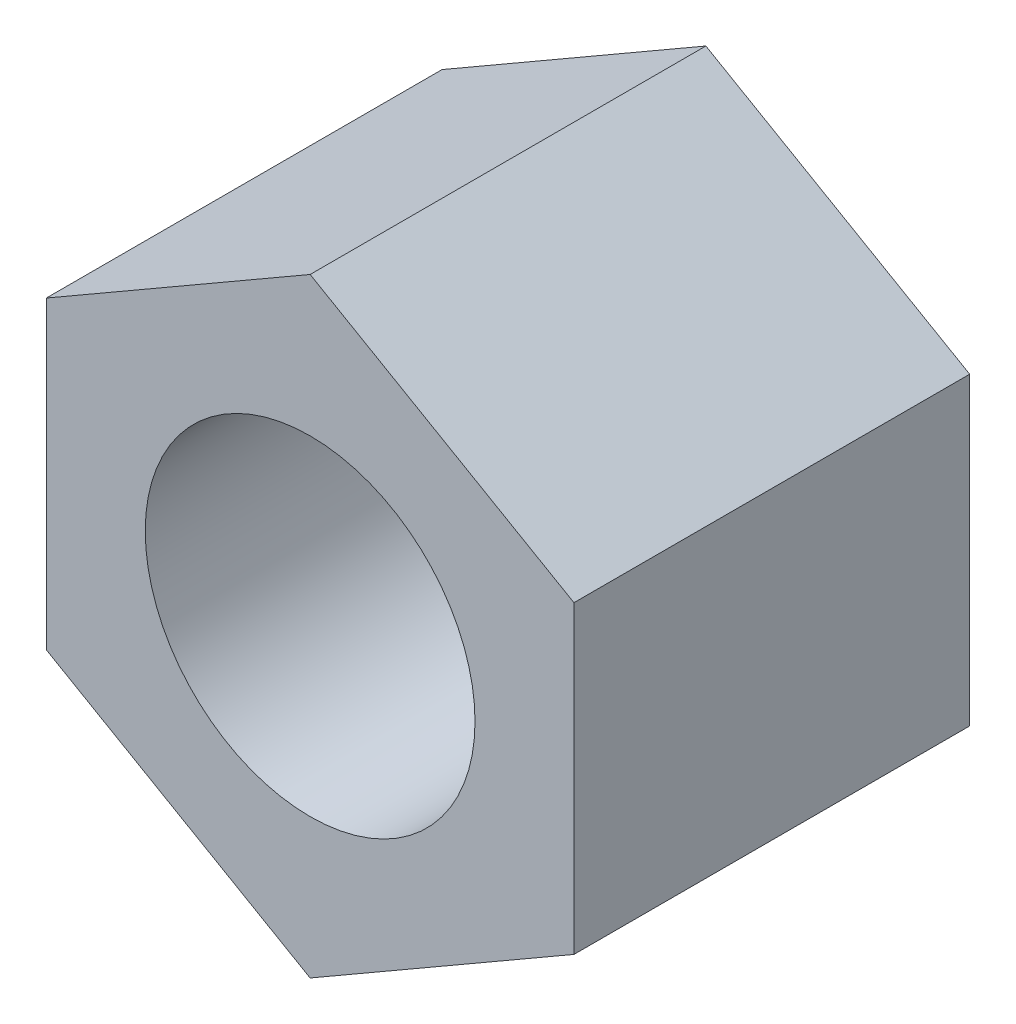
from build123d import *

# Parameters (mm, degrees)
ESQUISSE1_R          = 2.5
BASE_EXTRUSION_DEPTH = 6


with BuildPart() as part:
    # Esquisse1 → Base-Extrusion (new body)
    with BuildSketch(Plane.XY):
        Polygon((-4, -2.309401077), (0, -4.618802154), (4, -2.309401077), (4, 2.309401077), (0, 4.618802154), (-4, 2.309401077), align=None)
        Circle(ESQUISSE1_R, mode=Mode.SUBTRACT)
    extrude(amount=BASE_EXTRUSION_DEPTH)


solid = part.part
